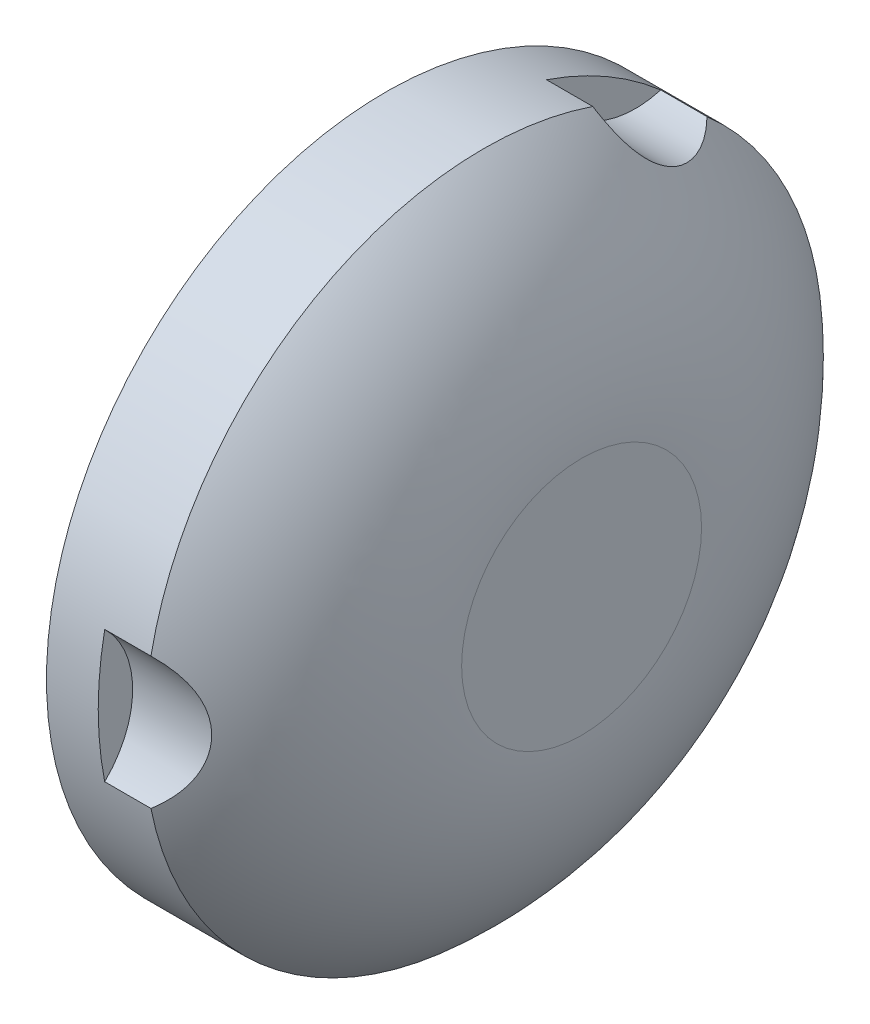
ISO-10303-21;
HEADER;
FILE_DESCRIPTION(('STEP AP214'),'2;1');
FILE_NAME('part.step','',(''),(''),'','','');
FILE_SCHEMA(('AUTOMOTIVE_DESIGN { 1 0 10303 214 1 1 1 1 }'));
ENDSEC;
DATA;
#1=APPLICATION_CONTEXT('core data for automotive mechanical design processes');
#2=APPLICATION_PROTOCOL_DEFINITION('international standard','automotive_design',2000,#1);
#3=PRODUCT_CONTEXT('',#1,'mechanical');
#4=PRODUCT('Part','Part','',(#3));
#5=PRODUCT_RELATED_PRODUCT_CATEGORY('part','',(#4));
#6=PRODUCT_DEFINITION_FORMATION('','',#4);
#7=PRODUCT_DEFINITION_CONTEXT('part definition',#1,'design');
#8=PRODUCT_DEFINITION('design','',#6,#7);
#9=PRODUCT_DEFINITION_SHAPE('','',#8);
#10=(LENGTH_UNIT() NAMED_UNIT(*) SI_UNIT(.MILLI.,.METRE.));
#11=(NAMED_UNIT(*) PLANE_ANGLE_UNIT() SI_UNIT($,.RADIAN.));
#12=(NAMED_UNIT(*) SI_UNIT($,.STERADIAN.) SOLID_ANGLE_UNIT());
#13=UNCERTAINTY_MEASURE_WITH_UNIT(LENGTH_MEASURE(1.E-05),#10,'distance_accuracy_value','');
#14=(GEOMETRIC_REPRESENTATION_CONTEXT(3) GLOBAL_UNCERTAINTY_ASSIGNED_CONTEXT((#13)) GLOBAL_UNIT_ASSIGNED_CONTEXT((#10,
#11,#12)) REPRESENTATION_CONTEXT('',''));
#15=CARTESIAN_POINT('',(0.,0.,0.));
#16=DIRECTION('',(0.,0.,1.));
#17=DIRECTION('',(1.,0.,0.));
#18=AXIS2_PLACEMENT_3D('',#15,#16,#17);
#19=CARTESIAN_POINT('',(-8.40551972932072,11.120379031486,-6.42035382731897));
#20=DIRECTION('',(1.,0.,0.));
#21=DIRECTION('',(0.,0.,-1.));
#22=AXIS2_PLACEMENT_3D('',#19,#20,#21);
#23=CYLINDRICAL_SURFACE('',#22,2.9718);
#24=CARTESIAN_POINT('',(3.175,8.26343589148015,-7.23856598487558));
#25=CARTESIAN_POINT('',(3.23203307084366,8.24673401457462,-7.18021747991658));
#26=CARTESIAN_POINT('',(3.28763892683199,8.23144059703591,-7.12008939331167));
#27=CARTESIAN_POINT('',(3.39571804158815,8.20420823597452,-6.9961918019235));
#28=CARTESIAN_POINT('',(3.44818613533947,8.1922747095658,-6.93241661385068));
#29=CARTESIAN_POINT('',(3.60090707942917,8.16225823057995,-6.73486708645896));
#30=CARTESIAN_POINT('',(3.69566473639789,8.15021021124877,-6.59568847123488));
#31=CARTESIAN_POINT('',(3.84973771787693,8.14754282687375,-6.33371144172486));
#32=CARTESIAN_POINT('',(3.91236417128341,8.15324240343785,-6.21292281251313));
#33=CARTESIAN_POINT('',(3.99511032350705,8.17389926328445,-6.02832417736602));
#34=CARTESIAN_POINT('',(4.02080733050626,8.1827883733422,-5.96628364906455));
#35=CARTESIAN_POINT('',(4.06822482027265,8.20482046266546,-5.84145493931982));
#36=CARTESIAN_POINT('',(4.08994701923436,8.21796159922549,-5.77866709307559));
#37=CARTESIAN_POINT('',(4.1293265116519,8.24881120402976,-5.6522620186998));
#38=CARTESIAN_POINT('',(4.14694445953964,8.26656068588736,-5.58864248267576));
#39=CARTESIAN_POINT('',(4.17760315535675,8.30663728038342,-5.46177371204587));
#40=CARTESIAN_POINT('',(4.19064618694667,8.32896210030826,-5.39852430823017));
#41=CARTESIAN_POINT('',(4.21197521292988,8.37818253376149,-5.27296611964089));
#42=CARTESIAN_POINT('',(4.22025911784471,8.4050801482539,-5.21065775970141));
#43=CARTESIAN_POINT('',(4.23193505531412,8.46327085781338,-5.08768419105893));
#44=CARTESIAN_POINT('',(4.23532773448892,8.49456337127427,-5.02701876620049));
#45=CARTESIAN_POINT('',(4.23782964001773,8.58614986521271,-4.86363050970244));
#46=CARTESIAN_POINT('',(4.23188477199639,8.65071962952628,-4.76314190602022));
#47=CARTESIAN_POINT('',(4.20518884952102,8.79029587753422,-4.57201980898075));
#48=CARTESIAN_POINT('',(4.18444304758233,8.86529865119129,-4.4813828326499));
#49=CARTESIAN_POINT('',(4.1296234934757,9.02154610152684,-4.31336088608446));
#50=CARTESIAN_POINT('',(4.09579782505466,9.10265319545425,-4.23576571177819));
#51=CARTESIAN_POINT('',(4.01615113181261,9.26949847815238,-4.09270684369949));
#52=CARTESIAN_POINT('',(3.97032392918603,9.35523903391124,-4.02724942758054));
#53=CARTESIAN_POINT('',(3.84913907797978,9.56117286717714,-3.88632610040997));
#54=CARTESIAN_POINT('',(3.76914053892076,9.68230025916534,-3.81621792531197));
#55=CARTESIAN_POINT('',(3.59325077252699,9.9233247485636,-3.69697108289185));
#56=CARTESIAN_POINT('',(3.49733730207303,10.0432198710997,-3.64786211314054));
#57=CARTESIAN_POINT('',(3.35991992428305,10.201314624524,-3.59391348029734));
#58=CARTESIAN_POINT('',(3.32380277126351,10.2417182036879,-3.58111146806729));
#59=CARTESIAN_POINT('',(3.25033301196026,10.3217006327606,-3.55758652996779));
#60=CARTESIAN_POINT('',(3.21298579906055,10.3612820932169,-3.5468556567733));
#61=CARTESIAN_POINT('',(3.175,10.4004999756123,-3.53706241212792));
#62=B_SPLINE_CURVE_WITH_KNOTS('',3,(#24,#25,#26,#27,#28,#29,#30,#31,#32,#33,#34,#35,#36,#37,#38,
#39,#40,#41,#42,#43,#44,#45,#46,#47,#48,#49,#50,#51,#52,#53,#54,#55,#56,#57,#58,#59,#60,#61),
.UNSPECIFIED.,.F.,.F.,(4,2,2,2,2,2,2,2,2,2,2,2,2,2,2,2,2,2,4),(0.,0.249764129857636,
0.499928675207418,1.00376626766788,1.41054019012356,1.61353497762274,1.8164419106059,
2.0212205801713,2.22589688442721,2.43066298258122,2.63540200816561,2.99223059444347,
3.34893261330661,3.69917702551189,4.04960208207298,4.53059007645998,5.01225606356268,
5.1792729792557,5.34563569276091),.UNSPECIFIED.);
#63=CARTESIAN_POINT('',(3.175,8.26343589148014,-7.23856598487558));
#64=VERTEX_POINT('',#63);
#65=CARTESIAN_POINT('',(3.175,10.4004999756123,-3.53706241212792));
#66=VERTEX_POINT('',#65);
#67=EDGE_CURVE('E147',#64,#66,#62,.T.);
#68=ORIENTED_EDGE('',*,*,#67,.F.);
#69=DIRECTION('',(1.,0.,0.));
#70=VECTOR('',#69,1.);
#71=CARTESIAN_POINT('',(-8.40551972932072,8.26343589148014,-7.23856598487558));
#72=LINE('',#71,#70);
#73=CARTESIAN_POINT('',(1.6764,8.26343589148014,-7.23856598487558));
#74=VERTEX_POINT('',#73);
#75=EDGE_CURVE('E75',#74,#64,#72,.T.);
#76=ORIENTED_EDGE('',*,*,#75,.F.);
#77=CARTESIAN_POINT('',(1.6764,11.120379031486,-6.42035382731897));
#78=DIRECTION('',(1.,0.,0.));
#79=DIRECTION('',(0.,0.,-1.));
#80=AXIS2_PLACEMENT_3D('',#77,#78,#79);
#81=CIRCLE('',#80,2.9718);
#82=CARTESIAN_POINT('',(1.6764,10.4004999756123,-3.53706241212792));
#83=VERTEX_POINT('',#82);
#84=EDGE_CURVE('E90',#74,#83,#81,.F.);
#85=ORIENTED_EDGE('',*,*,#84,.T.);
#86=DIRECTION('',(1.,0.,0.));
#87=VECTOR('',#86,1.);
#88=CARTESIAN_POINT('',(-8.40551972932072,10.4004999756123,-3.53706241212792));
#89=LINE('',#88,#87);
#90=EDGE_CURVE('E80',#66,#83,#89,.F.);
#91=ORIENTED_EDGE('',*,*,#90,.F.);
#92=EDGE_LOOP('',(#68,#76,#85,#91));
#93=FACE_BOUND('',#92,.T.);
#94=ADVANCED_FACE('F17',(#93),#23,.F.);
#95=CARTESIAN_POINT('',(-8.40551972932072,-11.1203790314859,-6.42035382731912));
#96=DIRECTION('',(1.,0.,0.));
#97=DIRECTION('',(0.,0.,-1.));
#98=AXIS2_PLACEMENT_3D('',#95,#96,#97);
#99=CYLINDRICAL_SURFACE('',#98,2.9718);
#100=CARTESIAN_POINT('',(3.175,-10.4004999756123,-3.53706241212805));
#101=CARTESIAN_POINT('',(3.23203307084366,-10.3416177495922,-3.55177241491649));
#102=CARTESIAN_POINT('',(3.28763892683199,-10.281898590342,-3.56859197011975));
#103=CARTESIAN_POINT('',(3.39571804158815,-10.1609839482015,-3.60695684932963));
#104=CARTESIAN_POINT('',(3.44818613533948,-10.0997862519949,-3.62850970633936));
#105=CARTESIAN_POINT('',(3.60090707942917,-9.91369510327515,-3.70128943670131));
#106=CARTESIAN_POINT('',(3.69566473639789,-9.78713887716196,-3.76044485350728));
#107=CARTESIAN_POINT('',(3.84973771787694,-9.55892642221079,-3.88912334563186));
#108=CARTESIAN_POINT('',(3.91236417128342,-9.45717018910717,-3.95445363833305));
#109=CARTESIAN_POINT('',(3.99511032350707,-9.30763151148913,-4.06464232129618));
#110=CARTESIAN_POINT('',(4.02080733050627,-9.25834739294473,-4.10336078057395));
#111=CARTESIAN_POINT('',(4.06822482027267,-9.16125860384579,-4.18485548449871));
#112=CARTESIAN_POINT('',(4.08994701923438,-9.11345330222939,-4.22762996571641));
#113=CARTESIAN_POINT('',(4.12932651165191,-9.01940809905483,-4.31754904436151));
#114=CARTESIAN_POINT('',(4.14694445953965,-8.97318670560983,-4.36473031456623));
#115=CARTESIAN_POINT('',(4.17760315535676,-8.88335342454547,-4.46287204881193));
#116=CARTESIAN_POINT('',(4.19064618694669,-8.83974024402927,-4.51383061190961));
#117=CARTESIAN_POINT('',(4.21197521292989,-8.75561387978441,-4.61923585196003));
#118=CARTESIAN_POINT('',(4.22025911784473,-8.71510206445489,-4.67368404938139));
#119=CARTESIAN_POINT('',(4.23193505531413,-8.63769918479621,-4.78556546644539));
#120=CARTESIAN_POINT('',(4.23532773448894,-8.60080764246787,-4.84299829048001));
#121=CARTESIAN_POINT('',(4.23782964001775,-8.50510250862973,-5.00400864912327));
#122=CARTESIAN_POINT('',(4.23188477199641,-8.45036170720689,-5.11017200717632));
#123=CARTESIAN_POINT('',(4.20518884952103,-8.35463323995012,-5.32660963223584));
#124=CARTESIAN_POINT('',(4.18444304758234,-8.31364070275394,-5.43688242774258));
#125=CARTESIAN_POINT('',(4.12962349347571,-8.24625315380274,-5.65620766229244));
#126=CARTESIAN_POINT('',(4.09579782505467,-8.21960730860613,-5.76524605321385));
#127=CARTESIAN_POINT('',(4.01615113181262,-8.17913733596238,-5.98126774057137));
#128=CARTESIAN_POINT('',(3.97032392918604,-8.16531982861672,-6.08824994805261));
#129=CARTESIAN_POINT('',(3.84913907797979,-8.14624356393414,-6.33705554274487));
#130=CARTESIAN_POINT('',(3.76914053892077,-8.14609179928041,-6.47700902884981));
#131=CARTESIAN_POINT('',(3.593250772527,-8.16333324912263,-6.74536578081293));
#132=CARTESIAN_POINT('',(3.49733730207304,-8.18075119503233,-6.87375248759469));
#133=CARTESIAN_POINT('',(3.35991992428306,-8.21307768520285,-7.03764087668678));
#134=CARTESIAN_POINT('',(3.32380277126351,-8.22219260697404,-7.07903240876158));
#135=CARTESIAN_POINT('',(3.25033301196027,-8.24181062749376,-7.16006169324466));
#136=CARTESIAN_POINT('',(3.21298579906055,-8.25230814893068,-7.19970568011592));
#137=CARTESIAN_POINT('',(3.175,-8.26343589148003,-7.23856598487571));
#138=B_SPLINE_CURVE_WITH_KNOTS('',3,(#100,#101,#102,#103,#104,#105,#106,#107,#108,#109,#110,
#111,#112,#113,#114,#115,#116,#117,#118,#119,#120,#121,#122,#123,#124,#125,#126,#127,#128,#129,
#130,#131,#132,#133,#134,#135,#136,#137),.UNSPECIFIED.,.F.,.F.,(4,2,2,2,2,2,2,2,2,2,2,2,2,2,2,2,
2,2,4),(0.,0.249764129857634,0.499928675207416,1.00376626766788,1.41054019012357,
1.61353497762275,1.81644191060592,2.02122058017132,2.22589688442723,2.43066298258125,
2.63540200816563,2.9922305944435,3.34893261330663,3.69917702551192,4.04960208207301,
4.53059007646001,5.01225606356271,5.17927297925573,5.34563569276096),.UNSPECIFIED.);
#139=CARTESIAN_POINT('',(3.175,-10.4004999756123,-3.53706241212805));
#140=VERTEX_POINT('',#139);
#141=CARTESIAN_POINT('',(3.175,-8.26343589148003,-7.23856598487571));
#142=VERTEX_POINT('',#141);
#143=EDGE_CURVE('E107',#140,#142,#138,.T.);
#144=ORIENTED_EDGE('',*,*,#143,.F.);
#145=DIRECTION('',(1.,0.,0.));
#146=VECTOR('',#145,1.);
#147=CARTESIAN_POINT('',(-8.40551972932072,-10.4004999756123,-3.53706241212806));
#148=LINE('',#147,#146);
#149=CARTESIAN_POINT('',(1.6764,-10.4004999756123,-3.53706241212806));
#150=VERTEX_POINT('',#149);
#151=EDGE_CURVE('E88',#150,#140,#148,.T.);
#152=ORIENTED_EDGE('',*,*,#151,.F.);
#153=CARTESIAN_POINT('',(1.6764,-11.1203790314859,-6.42035382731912));
#154=DIRECTION('',(1.,0.,0.));
#155=DIRECTION('',(0.,0.,-1.));
#156=AXIS2_PLACEMENT_3D('',#153,#154,#155);
#157=CIRCLE('',#156,2.9718);
#158=CARTESIAN_POINT('',(1.6764,-8.26343589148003,-7.23856598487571));
#159=VERTEX_POINT('',#158);
#160=EDGE_CURVE('E151',#150,#159,#157,.F.);
#161=ORIENTED_EDGE('',*,*,#160,.T.);
#162=DIRECTION('',(1.,0.,0.));
#163=VECTOR('',#162,1.);
#164=CARTESIAN_POINT('',(-8.40551972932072,-8.26343589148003,-7.23856598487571));
#165=LINE('',#164,#163);
#166=EDGE_CURVE('E204',#142,#159,#165,.F.);
#167=ORIENTED_EDGE('',*,*,#166,.F.);
#168=EDGE_LOOP('',(#144,#152,#161,#167));
#169=FACE_BOUND('',#168,.T.);
#170=ADVANCED_FACE('F119',(#169),#99,.F.);
#171=CARTESIAN_POINT('',(6.35,0.,0.));
#172=DIRECTION('',(1.,0.,0.));
#173=DIRECTION('',(0.,0.,-1.));
#174=AXIS2_PLACEMENT_3D('',#171,#172,#173);
#175=PLANE('',#174);
#176=CARTESIAN_POINT('',(6.35,0.,0.));
#177=DIRECTION('',(-1.,0.,0.));
#178=DIRECTION('',(0.,0.,1.));
#179=AXIS2_PLACEMENT_3D('',#176,#177,#178);
#180=CIRCLE('',#179,3.88598417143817);
#181=CARTESIAN_POINT('',(6.35,0.,3.88598417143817));
#182=VERTEX_POINT('',#181);
#183=CARTESIAN_POINT('',(6.35,0.,-3.88598417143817));
#184=VERTEX_POINT('',#183);
#185=EDGE_CURVE('E92',#182,#184,#180,.T.);
#186=ORIENTED_EDGE('',*,*,#185,.F.);
#187=CARTESIAN_POINT('',(6.35,0.,0.));
#188=DIRECTION('',(-1.,0.,0.));
#189=DIRECTION('',(0.,0.,-1.));
#190=AXIS2_PLACEMENT_3D('',#187,#188,#189);
#191=CIRCLE('',#190,3.88598417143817);
#192=EDGE_CURVE('E106',#184,#182,#191,.T.);
#193=ORIENTED_EDGE('',*,*,#192,.F.);
#194=EDGE_LOOP('',(#186,#193));
#195=FACE_BOUND('',#194,.T.);
#196=ADVANCED_FACE('F161',(#195),#175,.T.);
#197=CARTESIAN_POINT('',(-8.40551972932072,0.,12.8407076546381));
#198=DIRECTION('',(1.,0.,0.));
#199=DIRECTION('',(0.,0.,-1.));
#200=AXIS2_PLACEMENT_3D('',#197,#198,#199);
#201=CYLINDRICAL_SURFACE('',#200,2.9718);
#202=CARTESIAN_POINT('',(1.6764,0.,12.8407076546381));
#203=DIRECTION('',(1.,0.,0.));
#204=DIRECTION('',(0.,0.,-1.));
#205=AXIS2_PLACEMENT_3D('',#202,#203,#204);
#206=CIRCLE('',#205,2.9718);
#207=CARTESIAN_POINT('',(1.6764,2.13706408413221,10.7756283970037));
#208=VERTEX_POINT('',#207);
#209=CARTESIAN_POINT('',(1.6764,-2.13706408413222,10.7756283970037));
#210=VERTEX_POINT('',#209);
#211=EDGE_CURVE('E100',#208,#210,#206,.F.);
#212=ORIENTED_EDGE('',*,*,#211,.T.);
#213=DIRECTION('',(1.,0.,0.));
#214=VECTOR('',#213,1.);
#215=CARTESIAN_POINT('',(-8.40551972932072,-2.13706408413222,10.7756283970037));
#216=LINE('',#215,#214);
#217=CARTESIAN_POINT('',(3.175,-2.13706408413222,10.7756283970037));
#218=VERTEX_POINT('',#217);
#219=EDGE_CURVE('E38',#218,#210,#216,.F.);
#220=ORIENTED_EDGE('',*,*,#219,.F.);
#221=CARTESIAN_POINT('',(3.175,2.13706408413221,10.7756283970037));
#222=CARTESIAN_POINT('',(3.23203725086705,2.09487827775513,10.7319865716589));
#223=CARTESIAN_POINT('',(3.28764570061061,2.05045142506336,10.688676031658));
#224=CARTESIAN_POINT('',(3.39573022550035,1.9567658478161,10.6031389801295));
#225=CARTESIAN_POINT('',(3.44820109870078,1.90749943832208,10.5609143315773));
#226=CARTESIAN_POINT('',(3.60092071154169,1.75141652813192,10.4361449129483));
#227=CARTESIAN_POINT('',(3.69567969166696,1.63688977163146,10.3561200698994));
#228=CARTESIAN_POINT('',(3.84972713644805,1.41141281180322,10.2228441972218));
#229=CARTESIAN_POINT('',(3.91233212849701,1.30402337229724,10.1674051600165));
#230=CARTESIAN_POINT('',(4.02261640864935,1.07712706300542,10.0682315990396));
#231=CARTESIAN_POINT('',(4.07033992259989,0.957657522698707,10.0244624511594));
#232=CARTESIAN_POINT('',(4.14397762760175,0.724146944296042,9.95623737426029));
#233=CARTESIAN_POINT('',(4.17184016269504,0.611216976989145,9.93007845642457));
#234=CARTESIAN_POINT('',(4.21319818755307,0.380614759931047,9.89107653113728));
#235=CARTESIAN_POINT('',(4.22672410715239,0.26295310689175,9.87820532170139));
#236=CARTESIAN_POINT('',(4.23402377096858,0.120665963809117,9.87125926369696));
#237=CARTESIAN_POINT('',(4.23494968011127,0.0965533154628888,9.87037822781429));
#238=CARTESIAN_POINT('',(4.23618512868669,0.0482948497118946,9.86920235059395));
#239=CARTESIAN_POINT('',(4.23649465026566,0.0241490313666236,9.86890752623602));
#240=CARTESIAN_POINT('',(4.23649431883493,-0.0632951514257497,9.868907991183));
#241=CARTESIAN_POINT('',(4.23436711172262,-0.126612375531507,9.87093458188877));
#242=CARTESIAN_POINT('',(4.22588502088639,-0.252736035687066,9.8789989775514));
#243=CARTESIAN_POINT('',(4.2195271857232,-0.315542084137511,9.88503958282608));
#244=CARTESIAN_POINT('',(4.20264762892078,-0.440228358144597,9.90102230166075));
#245=CARTESIAN_POINT('',(4.19211727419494,-0.502106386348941,9.91097250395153));
#246=CARTESIAN_POINT('',(4.16703509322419,-0.624334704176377,9.93456142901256));
#247=CARTESIAN_POINT('',(4.15248141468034,-0.684684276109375,9.9482018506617));
#248=CARTESIAN_POINT('',(4.10325171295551,-0.862006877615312,9.99407268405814));
#249=CARTESIAN_POINT('',(4.06288001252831,-0.97616866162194,10.0313756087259));
#250=CARTESIAN_POINT('',(3.96873634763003,-1.19423723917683,10.1168923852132));
#251=CARTESIAN_POINT('',(3.91496124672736,-1.29814162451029,10.1651087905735));
#252=CARTESIAN_POINT('',(3.77599957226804,-1.52747816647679,10.2871932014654));
#253=CARTESIAN_POINT('',(3.68632238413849,-1.64848954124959,10.3642472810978));
#254=CARTESIAN_POINT('',(3.4909546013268,-1.86982594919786,10.5267779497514));
#255=CARTESIAN_POINT('',(3.38526018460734,-1.97014603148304,10.6122565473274));
#256=CARTESIAN_POINT('',(3.2411205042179,-2.08704389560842,10.7247781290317));
#257=CARTESIAN_POINT('',(3.20829367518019,-2.11244724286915,10.7501562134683));
#258=CARTESIAN_POINT('',(3.175,-2.13706408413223,10.7756283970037));
#259=B_SPLINE_CURVE_WITH_KNOTS('',3,(#221,#222,#223,#224,#225,#226,#227,#228,#229,#230,#231,
#232,#233,#234,#235,#236,#237,#238,#239,#240,#241,#242,#243,#244,#245,#246,#247,#248,#249,#250,
#251,#252,#253,#254,#255,#256,#257,#258),.UNSPECIFIED.,.F.,.F.,(4,2,2,2,2,2,2,2,2,2,2,2,2,2,2,2,
2,2,4),(0.,0.249778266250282,0.499959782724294,1.00376635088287,1.41052404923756,
1.81606113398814,2.17220546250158,2.52759234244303,2.60002598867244,2.67246173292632,
2.86231743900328,3.05230573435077,3.24268919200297,3.43316044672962,3.81134582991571,
4.18961979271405,4.69439433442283,5.19928951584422,5.34519306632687),.UNSPECIFIED.);
#260=CARTESIAN_POINT('',(3.175,2.13706408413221,10.7756283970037));
#261=VERTEX_POINT('',#260);
#262=EDGE_CURVE('E113',#261,#218,#259,.T.);
#263=ORIENTED_EDGE('',*,*,#262,.F.);
#264=DIRECTION('',(1.,0.,0.));
#265=VECTOR('',#264,1.);
#266=CARTESIAN_POINT('',(-8.40551972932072,2.13706408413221,10.7756283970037));
#267=LINE('',#266,#265);
#268=EDGE_CURVE('E205',#208,#261,#267,.T.);
#269=ORIENTED_EDGE('',*,*,#268,.F.);
#270=EDGE_LOOP('',(#212,#220,#263,#269));
#271=FACE_BOUND('',#270,.T.);
#272=ADVANCED_FACE('F175',(#271),#201,.F.);
#273=CARTESIAN_POINT('',(1.6764,0.,0.));
#274=DIRECTION('',(-1.,0.,0.));
#275=DIRECTION('',(0.,0.,1.));
#276=AXIS2_PLACEMENT_3D('',#273,#274,#275);
#277=PLANE('',#276);
#278=ORIENTED_EDGE('',*,*,#84,.F.);
#279=CARTESIAN_POINT('',(1.6764,0.,0.));
#280=DIRECTION('',(1.,0.,0.));
#281=DIRECTION('',(0.,0.,-1.));
#282=AXIS2_PLACEMENT_3D('',#279,#280,#281);
#283=CIRCLE('',#282,10.9855);
#284=EDGE_CURVE('E83',#83,#74,#283,.F.);
#285=ORIENTED_EDGE('',*,*,#284,.F.);
#286=EDGE_LOOP('',(#278,#285));
#287=FACE_BOUND('',#286,.T.);
#288=ADVANCED_FACE('F94',(#287),#277,.F.);
#289=CARTESIAN_POINT('',(1.6764,0.,0.));
#290=DIRECTION('',(-1.,0.,0.));
#291=DIRECTION('',(0.,0.,1.));
#292=AXIS2_PLACEMENT_3D('',#289,#290,#291);
#293=PLANE('',#292);
#294=ORIENTED_EDGE('',*,*,#160,.F.);
#295=CARTESIAN_POINT('',(1.6764,0.,0.));
#296=DIRECTION('',(1.,0.,0.));
#297=DIRECTION('',(0.,0.,-1.));
#298=AXIS2_PLACEMENT_3D('',#295,#296,#297);
#299=CIRCLE('',#298,10.9855);
#300=EDGE_CURVE('E98',#159,#150,#299,.F.);
#301=ORIENTED_EDGE('',*,*,#300,.F.);
#302=EDGE_LOOP('',(#294,#301));
#303=FACE_BOUND('',#302,.T.);
#304=ADVANCED_FACE('F129',(#303),#293,.F.);
#305=CARTESIAN_POINT('',(-3.175,0.,-3.88598417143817));
#306=DIRECTION('',(0.,1.,0.));
#307=DIRECTION('',(0.,0.,-1.));
#308=AXIS2_PLACEMENT_3D('',#305,#306,#307);
#309=CIRCLE('',#308,9.525);
#310=TRIMMED_CURVE('',#309,(PARAMETER_VALUE(-1.99103387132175)),
(PARAMETER_VALUE(1.99103387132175)),.T.,.PARAMETER.);
#311=CARTESIAN_POINT('',(-3.175,0.,0.));
#312=DIRECTION('',(1.,0.,0.));
#313=AXIS1_PLACEMENT('',#311,#312);
#314=SURFACE_OF_REVOLUTION('',#310,#313);
#315=CARTESIAN_POINT('',(3.175,0.,0.));
#316=DIRECTION('',(1.,0.,0.));
#317=DIRECTION('',(0.,0.,-1.));
#318=AXIS2_PLACEMENT_3D('',#315,#316,#317);
#319=CIRCLE('',#318,10.9855);
#320=EDGE_CURVE('E86',#261,#66,#319,.F.);
#321=ORIENTED_EDGE('',*,*,#320,.F.);
#322=ORIENTED_EDGE('',*,*,#262,.T.);
#323=CARTESIAN_POINT('',(3.175,0.,0.));
#324=DIRECTION('',(1.,0.,0.));
#325=DIRECTION('',(0.,0.,-1.));
#326=AXIS2_PLACEMENT_3D('',#323,#324,#325);
#327=CIRCLE('',#326,10.9855);
#328=EDGE_CURVE('E138',#140,#218,#327,.F.);
#329=ORIENTED_EDGE('',*,*,#328,.F.);
#330=ORIENTED_EDGE('',*,*,#143,.T.);
#331=CARTESIAN_POINT('',(3.175,0.,0.));
#332=DIRECTION('',(1.,0.,0.));
#333=DIRECTION('',(0.,0.,-1.));
#334=AXIS2_PLACEMENT_3D('',#331,#332,#333);
#335=CIRCLE('',#334,10.9855);
#336=EDGE_CURVE('E95',#64,#142,#335,.F.);
#337=ORIENTED_EDGE('',*,*,#336,.F.);
#338=ORIENTED_EDGE('',*,*,#67,.T.);
#339=EDGE_LOOP('',(#321,#322,#329,#330,#337,#338));
#340=FACE_BOUND('',#339,.T.);
#341=ORIENTED_EDGE('',*,*,#192,.T.);
#342=ORIENTED_EDGE('',*,*,#185,.T.);
#343=EDGE_LOOP('',(#341,#342));
#344=FACE_BOUND('',#343,.T.);
#345=ADVANCED_FACE('F122',(#340,#344),#314,.F.);
#346=CARTESIAN_POINT('',(1.6764,0.,0.));
#347=DIRECTION('',(-1.,0.,0.));
#348=DIRECTION('',(0.,0.,1.));
#349=AXIS2_PLACEMENT_3D('',#346,#347,#348);
#350=PLANE('',#349);
#351=CARTESIAN_POINT('',(1.6764,0.,0.));
#352=DIRECTION('',(1.,0.,0.));
#353=DIRECTION('',(0.,0.,-1.));
#354=AXIS2_PLACEMENT_3D('',#351,#352,#353);
#355=CIRCLE('',#354,10.9855);
#356=EDGE_CURVE('E29',#210,#208,#355,.F.);
#357=ORIENTED_EDGE('',*,*,#356,.F.);
#358=ORIENTED_EDGE('',*,*,#211,.F.);
#359=EDGE_LOOP('',(#357,#358));
#360=FACE_BOUND('',#359,.T.);
#361=ADVANCED_FACE('F128',(#360),#350,.F.);
#362=CARTESIAN_POINT('',(0.,0.,0.));
#363=DIRECTION('',(1.,0.,0.));
#364=DIRECTION('',(0.,0.,-1.));
#365=AXIS2_PLACEMENT_3D('',#362,#363,#364);
#366=CYLINDRICAL_SURFACE('',#365,10.9855);
#367=CARTESIAN_POINT('',(0.,0.,0.));
#368=DIRECTION('',(1.,0.,0.));
#369=DIRECTION('',(0.,0.,-1.));
#370=AXIS2_PLACEMENT_3D('',#367,#368,#369);
#371=CIRCLE('',#370,10.9855);
#372=CARTESIAN_POINT('',(0.,0.,-10.9855));
#373=VERTEX_POINT('',#372);
#374=EDGE_CURVE('E11',#373,#373,#371,.F.);
#375=ORIENTED_EDGE('',*,*,#374,.F.);
#376=EDGE_LOOP('',(#375));
#377=FACE_BOUND('',#376,.T.);
#378=ORIENTED_EDGE('',*,*,#219,.T.);
#379=ORIENTED_EDGE('',*,*,#356,.T.);
#380=ORIENTED_EDGE('',*,*,#268,.T.);
#381=ORIENTED_EDGE('',*,*,#320,.T.);
#382=ORIENTED_EDGE('',*,*,#90,.T.);
#383=ORIENTED_EDGE('',*,*,#284,.T.);
#384=ORIENTED_EDGE('',*,*,#75,.T.);
#385=ORIENTED_EDGE('',*,*,#336,.T.);
#386=ORIENTED_EDGE('',*,*,#166,.T.);
#387=ORIENTED_EDGE('',*,*,#300,.T.);
#388=ORIENTED_EDGE('',*,*,#151,.T.);
#389=ORIENTED_EDGE('',*,*,#328,.T.);
#390=EDGE_LOOP('',(#378,#379,#380,#381,#382,#383,#384,#385,#386,#387,#388,#389));
#391=FACE_BOUND('',#390,.T.);
#392=ADVANCED_FACE('F81',(#377,#391),#366,.T.);
#393=CARTESIAN_POINT('',(0.,0.,0.));
#394=DIRECTION('',(-1.,0.,0.));
#395=DIRECTION('',(0.,0.,1.));
#396=AXIS2_PLACEMENT_3D('',#393,#394,#395);
#397=PLANE('',#396);
#398=ORIENTED_EDGE('',*,*,#374,.T.);
#399=EDGE_LOOP('',(#398));
#400=FACE_BOUND('',#399,.T.);
#401=ADVANCED_FACE('F184',(#400),#397,.T.);
#402=CLOSED_SHELL('',(#94,#170,#196,#272,#288,#304,#345,#361,#392,#401));
#403=MANIFOLD_SOLID_BREP('B1',#402);
#404=ADVANCED_BREP_SHAPE_REPRESENTATION('',(#18,#403),#14);
#405=SHAPE_DEFINITION_REPRESENTATION(#9,#404);
ENDSEC;
END-ISO-10303-21;
